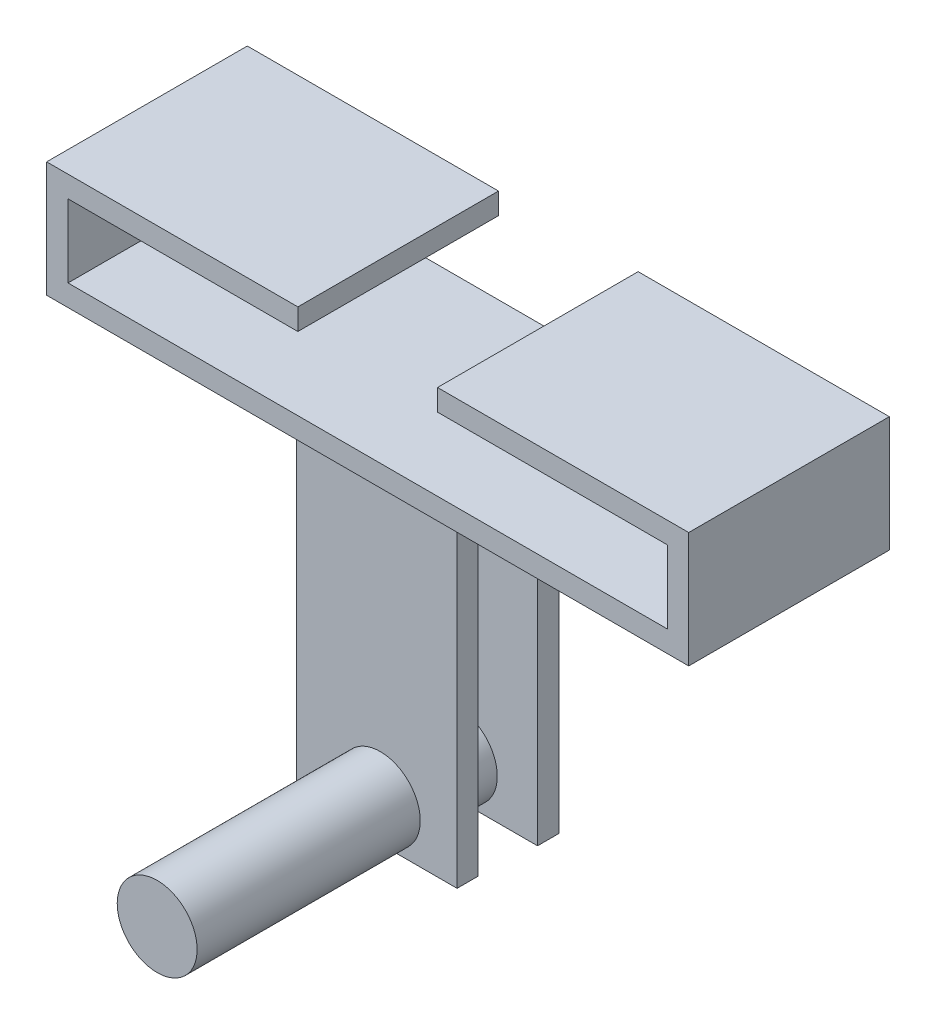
ISO-10303-21;
HEADER;
FILE_DESCRIPTION(('STEP AP214'),'2;1');
FILE_NAME('part.step','',(''),(''),'','','');
FILE_SCHEMA(('AUTOMOTIVE_DESIGN { 1 0 10303 214 1 1 1 1 }'));
ENDSEC;
DATA;
#1=APPLICATION_CONTEXT('core data for automotive mechanical design processes');
#2=APPLICATION_PROTOCOL_DEFINITION('international standard','automotive_design',2000,#1);
#3=PRODUCT_CONTEXT('',#1,'mechanical');
#4=PRODUCT('Part','Part','',(#3));
#5=PRODUCT_RELATED_PRODUCT_CATEGORY('part','',(#4));
#6=PRODUCT_DEFINITION_FORMATION('','',#4);
#7=PRODUCT_DEFINITION_CONTEXT('part definition',#1,'design');
#8=PRODUCT_DEFINITION('design','',#6,#7);
#9=PRODUCT_DEFINITION_SHAPE('','',#8);
#10=(LENGTH_UNIT() NAMED_UNIT(*) SI_UNIT(.MILLI.,.METRE.));
#11=(NAMED_UNIT(*) PLANE_ANGLE_UNIT() SI_UNIT($,.RADIAN.));
#12=(NAMED_UNIT(*) SI_UNIT($,.STERADIAN.) SOLID_ANGLE_UNIT());
#13=UNCERTAINTY_MEASURE_WITH_UNIT(LENGTH_MEASURE(1.E-05),#10,'distance_accuracy_value','');
#14=(GEOMETRIC_REPRESENTATION_CONTEXT(3) GLOBAL_UNCERTAINTY_ASSIGNED_CONTEXT((#13)) GLOBAL_UNIT_ASSIGNED_CONTEXT((#10,
#11,#12)) REPRESENTATION_CONTEXT('',''));
#15=CARTESIAN_POINT('',(0.,0.,0.));
#16=DIRECTION('',(0.,0.,1.));
#17=DIRECTION('',(1.,0.,0.));
#18=AXIS2_PLACEMENT_3D('',#15,#16,#17);
#19=CARTESIAN_POINT('',(0.,0.,0.));
#20=DIRECTION('',(0.,-1.,0.));
#21=DIRECTION('',(0.,0.,-1.));
#22=AXIS2_PLACEMENT_3D('',#19,#20,#21);
#23=PLANE('',#22);
#24=DIRECTION('',(0.,0.,-1.));
#25=VECTOR('',#24,1.);
#26=CARTESIAN_POINT('',(0.,0.,0.));
#27=LINE('',#26,#25);
#28=CARTESIAN_POINT('',(0.,0.,0.));
#29=VERTEX_POINT('',#28);
#30=CARTESIAN_POINT('',(0.,0.,-31.75));
#31=VERTEX_POINT('',#30);
#32=EDGE_CURVE('E298',#29,#31,#27,.T.);
#33=ORIENTED_EDGE('',*,*,#32,.T.);
#34=DIRECTION('',(1.,0.,0.));
#35=VECTOR('',#34,1.);
#36=CARTESIAN_POINT('',(0.,0.,-31.75));
#37=LINE('',#36,#35);
#38=CARTESIAN_POINT('',(101.6,0.,-31.75));
#39=VERTEX_POINT('',#38);
#40=EDGE_CURVE('E322',#31,#39,#37,.T.);
#41=ORIENTED_EDGE('',*,*,#40,.T.);
#42=DIRECTION('',(0.,0.,-1.));
#43=VECTOR('',#42,1.);
#44=CARTESIAN_POINT('',(101.6,0.,0.));
#45=LINE('',#44,#43);
#46=CARTESIAN_POINT('',(101.6,0.,0.));
#47=VERTEX_POINT('',#46);
#48=EDGE_CURVE('E325',#47,#39,#45,.T.);
#49=ORIENTED_EDGE('',*,*,#48,.F.);
#50=DIRECTION('',(1.,0.,0.));
#51=VECTOR('',#50,1.);
#52=CARTESIAN_POINT('',(0.,0.,0.));
#53=LINE('',#52,#51);
#54=EDGE_CURVE('E308',#29,#47,#53,.T.);
#55=ORIENTED_EDGE('',*,*,#54,.F.);
#56=EDGE_LOOP('',(#33,#41,#49,#55));
#57=FACE_BOUND('',#56,.T.);
#58=DIRECTION('',(-1.,0.,0.));
#59=VECTOR('',#58,1.);
#60=CARTESIAN_POINT('',(63.48984,0.,-14.1859));
#61=LINE('',#60,#59);
#62=CARTESIAN_POINT('',(63.48984,0.,-14.1859));
#63=VERTEX_POINT('',#62);
#64=CARTESIAN_POINT('',(38.11016,0.,-14.1859));
#65=VERTEX_POINT('',#64);
#66=EDGE_CURVE('E234',#63,#65,#61,.T.);
#67=ORIENTED_EDGE('',*,*,#66,.F.);
#68=DIRECTION('',(0.,0.,1.));
#69=VECTOR('',#68,1.);
#70=CARTESIAN_POINT('',(63.48984,0.,-17.5641));
#71=LINE('',#70,#69);
#72=CARTESIAN_POINT('',(63.48984,0.,-17.5641));
#73=VERTEX_POINT('',#72);
#74=EDGE_CURVE('E219',#73,#63,#71,.T.);
#75=ORIENTED_EDGE('',*,*,#74,.F.);
#76=DIRECTION('',(1.,0.,0.));
#77=VECTOR('',#76,1.);
#78=CARTESIAN_POINT('',(63.48984,0.,-17.5641));
#79=LINE('',#78,#77);
#80=CARTESIAN_POINT('',(38.11016,0.,-17.5641));
#81=VERTEX_POINT('',#80);
#82=EDGE_CURVE('E225',#81,#73,#79,.T.);
#83=ORIENTED_EDGE('',*,*,#82,.F.);
#84=DIRECTION('',(0.,0.,-1.));
#85=VECTOR('',#84,1.);
#86=CARTESIAN_POINT('',(38.11016,0.,-17.5641));
#87=LINE('',#86,#85);
#88=EDGE_CURVE('E236',#65,#81,#87,.T.);
#89=ORIENTED_EDGE('',*,*,#88,.F.);
#90=EDGE_LOOP('',(#67,#75,#83,#89));
#91=FACE_BOUND('',#90,.T.);
#92=DIRECTION('',(1.,0.,0.));
#93=VECTOR('',#92,1.);
#94=CARTESIAN_POINT('',(37.552154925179,0.,-5.2959));
#95=LINE('',#94,#93);
#96=CARTESIAN_POINT('',(37.552154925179,0.,-5.2959));
#97=VERTEX_POINT('',#96);
#98=CARTESIAN_POINT('',(62.952154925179,0.,-5.2959));
#99=VERTEX_POINT('',#98);
#100=EDGE_CURVE('E597',#97,#99,#95,.T.);
#101=ORIENTED_EDGE('',*,*,#100,.F.);
#102=DIRECTION('',(0.,0.,-1.));
#103=VECTOR('',#102,1.);
#104=CARTESIAN_POINT('',(37.552154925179,0.,-5.2959));
#105=LINE('',#104,#103);
#106=CARTESIAN_POINT('',(37.552154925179,0.,-1.9939));
#107=VERTEX_POINT('',#106);
#108=EDGE_CURVE('E208',#107,#97,#105,.T.);
#109=ORIENTED_EDGE('',*,*,#108,.F.);
#110=DIRECTION('',(-1.,0.,0.));
#111=VECTOR('',#110,1.);
#112=CARTESIAN_POINT('',(37.552154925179,0.,-1.9939));
#113=LINE('',#112,#111);
#114=CARTESIAN_POINT('',(62.952154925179,0.,-1.9939));
#115=VERTEX_POINT('',#114);
#116=EDGE_CURVE('E204',#115,#107,#113,.T.);
#117=ORIENTED_EDGE('',*,*,#116,.F.);
#118=DIRECTION('',(0.,0.,1.));
#119=VECTOR('',#118,1.);
#120=CARTESIAN_POINT('',(62.952154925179,0.,-5.2959));
#121=LINE('',#120,#119);
#122=EDGE_CURVE('E594',#99,#115,#121,.T.);
#123=ORIENTED_EDGE('',*,*,#122,.F.);
#124=EDGE_LOOP('',(#101,#109,#117,#123));
#125=FACE_BOUND('',#124,.T.);
#126=ADVANCED_FACE('F47',(#57,#91,#125),#23,.T.);
#127=CARTESIAN_POINT('',(50.8,-44.45,33.3121));
#128=DIRECTION('',(0.,0.,-1.));
#129=DIRECTION('',(-1.,0.,0.));
#130=AXIS2_PLACEMENT_3D('',#127,#128,#129);
#131=CYLINDRICAL_SURFACE('',#130,6.3246);
#132=CARTESIAN_POINT('',(50.8,-44.45,-14.1859));
#133=DIRECTION('',(0.,0.,1.));
#134=DIRECTION('',(1.,0.,0.));
#135=AXIS2_PLACEMENT_3D('',#132,#133,#134);
#136=CIRCLE('',#135,6.3246);
#137=CARTESIAN_POINT('',(44.4754,-44.45,-14.1859));
#138=VERTEX_POINT('',#137);
#139=EDGE_CURVE('E210',#138,#138,#136,.T.);
#140=CARTESIAN_POINT('',(50.8,-44.45,-5.2959));
#141=DIRECTION('',(0.,0.,1.));
#142=DIRECTION('',(1.,0.,0.));
#143=AXIS2_PLACEMENT_3D('',#140,#141,#142);
#144=CIRCLE('',#143,6.3246);
#145=CARTESIAN_POINT('',(44.4754,-44.45,-5.2959));
#146=VERTEX_POINT('',#145);
#147=EDGE_CURVE('E11',#146,#146,#144,.T.);
#148=CARTESIAN_POINT('',(44.4754,-44.45,-14.1859));
#149=CARTESIAN_POINT('',(44.4754,-44.45,-14.0932958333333));
#150=CARTESIAN_POINT('',(44.4754,-44.45,-14.0006916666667));
#151=CARTESIAN_POINT('',(44.4754,-44.45,-13.8154833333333));
#152=CARTESIAN_POINT('',(44.4754,-44.45,-13.7228791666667));
#153=CARTESIAN_POINT('',(44.4754,-44.45,-13.5376708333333));
#154=CARTESIAN_POINT('',(44.4754,-44.45,-13.4450666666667));
#155=CARTESIAN_POINT('',(44.4754,-44.45,-13.2598583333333));
#156=CARTESIAN_POINT('',(44.4754,-44.45,-13.1672541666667));
#157=CARTESIAN_POINT('',(44.4754,-44.45,-12.9820458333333));
#158=CARTESIAN_POINT('',(44.4754,-44.45,-12.8894416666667));
#159=CARTESIAN_POINT('',(44.4754,-44.45,-12.7042333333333));
#160=CARTESIAN_POINT('',(44.4754,-44.45,-12.6116291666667));
#161=CARTESIAN_POINT('',(44.4754,-44.45,-12.4264208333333));
#162=CARTESIAN_POINT('',(44.4754,-44.45,-12.3338166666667));
#163=CARTESIAN_POINT('',(44.4754,-44.45,-12.1486083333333));
#164=CARTESIAN_POINT('',(44.4754,-44.45,-12.0560041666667));
#165=CARTESIAN_POINT('',(44.4754,-44.45,-11.8707958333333));
#166=CARTESIAN_POINT('',(44.4754,-44.45,-11.7781916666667));
#167=CARTESIAN_POINT('',(44.4754,-44.45,-11.5929833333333));
#168=CARTESIAN_POINT('',(44.4754,-44.45,-11.5003791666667));
#169=CARTESIAN_POINT('',(44.4754,-44.45,-11.3151708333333));
#170=CARTESIAN_POINT('',(44.4754,-44.45,-11.2225666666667));
#171=CARTESIAN_POINT('',(44.4754,-44.45,-11.0373583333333));
#172=CARTESIAN_POINT('',(44.4754,-44.45,-10.9447541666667));
#173=CARTESIAN_POINT('',(44.4754,-44.45,-10.7595458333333));
#174=CARTESIAN_POINT('',(44.4754,-44.45,-10.6669416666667));
#175=CARTESIAN_POINT('',(44.4754,-44.45,-10.4817333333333));
#176=CARTESIAN_POINT('',(44.4754,-44.45,-10.3891291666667));
#177=CARTESIAN_POINT('',(44.4754,-44.45,-10.2039208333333));
#178=CARTESIAN_POINT('',(44.4754,-44.45,-10.1113166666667));
#179=CARTESIAN_POINT('',(44.4754,-44.45,-9.92610833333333));
#180=CARTESIAN_POINT('',(44.4754,-44.45,-9.83350416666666));
#181=CARTESIAN_POINT('',(44.4754,-44.45,-9.64829583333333));
#182=CARTESIAN_POINT('',(44.4754,-44.45,-9.55569166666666));
#183=CARTESIAN_POINT('',(44.4754,-44.45,-9.37048333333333));
#184=CARTESIAN_POINT('',(44.4754,-44.45,-9.27787916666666));
#185=CARTESIAN_POINT('',(44.4754,-44.45,-9.09267083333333));
#186=CARTESIAN_POINT('',(44.4754,-44.45,-9.00006666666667));
#187=CARTESIAN_POINT('',(44.4754,-44.45,-8.81485833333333));
#188=CARTESIAN_POINT('',(44.4754,-44.45,-8.72225416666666));
#189=CARTESIAN_POINT('',(44.4754,-44.45,-8.53704583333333));
#190=CARTESIAN_POINT('',(44.4754,-44.45,-8.44444166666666));
#191=CARTESIAN_POINT('',(44.4754,-44.45,-8.25923333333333));
#192=CARTESIAN_POINT('',(44.4754,-44.45,-8.16662916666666));
#193=CARTESIAN_POINT('',(44.4754,-44.45,-7.98142083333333));
#194=CARTESIAN_POINT('',(44.4754,-44.45,-7.88881666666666));
#195=CARTESIAN_POINT('',(44.4754,-44.45,-7.70360833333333));
#196=CARTESIAN_POINT('',(44.4754,-44.45,-7.61100416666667));
#197=CARTESIAN_POINT('',(44.4754,-44.45,-7.42579583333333));
#198=CARTESIAN_POINT('',(44.4754,-44.45,-7.33319166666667));
#199=CARTESIAN_POINT('',(44.4754,-44.45,-7.14798333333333));
#200=CARTESIAN_POINT('',(44.4754,-44.45,-7.05537916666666));
#201=CARTESIAN_POINT('',(44.4754,-44.45,-6.87017083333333));
#202=CARTESIAN_POINT('',(44.4754,-44.45,-6.77756666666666));
#203=CARTESIAN_POINT('',(44.4754,-44.45,-6.59235833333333));
#204=CARTESIAN_POINT('',(44.4754,-44.45,-6.49975416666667));
#205=CARTESIAN_POINT('',(44.4754,-44.45,-6.31454583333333));
#206=CARTESIAN_POINT('',(44.4754,-44.45,-6.22194166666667));
#207=CARTESIAN_POINT('',(44.4754,-44.45,-6.03673333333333));
#208=CARTESIAN_POINT('',(44.4754,-44.45,-5.94412916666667));
#209=CARTESIAN_POINT('',(44.4754,-44.45,-5.75892083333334));
#210=CARTESIAN_POINT('',(44.4754,-44.45,-5.66631666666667));
#211=CARTESIAN_POINT('',(44.4754,-44.45,-5.48110833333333));
#212=CARTESIAN_POINT('',(44.4754,-44.45,-5.38850416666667));
#213=CARTESIAN_POINT('',(44.4754,-44.45,-5.2959));
#214=B_SPLINE_CURVE_WITH_KNOTS('',3,(#148,#149,#150,#151,#152,#153,#154,#155,#156,#157,#158,
#159,#160,#161,#162,#163,#164,#165,#166,#167,#168,#169,#170,#171,#172,#173,#174,#175,#176,#177,
#178,#179,#180,#181,#182,#183,#184,#185,#186,#187,#188,#189,#190,#191,#192,#193,#194,#195,#196,
#197,#198,#199,#200,#201,#202,#203,#204,#205,#206,#207,#208,#209,#210,#211,#212,#213),
.UNSPECIFIED.,.F.,.F.,(4,2,2,2,2,2,2,2,2,2,2,2,2,2,2,2,2,2,2,2,2,2,2,2,2,2,2,2,2,2,2,2,4),(0.,
0.277812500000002,0.555624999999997,0.833437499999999,1.11125,1.3890625,1.666875,1.9446875,
2.2225,2.5003125,2.778125,3.0559375,3.33375,3.6115625,3.889375,4.1671875,4.445,4.7228125,
5.00062499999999,5.2784375,5.55625,5.8340625,6.111875,6.3896875,6.66749999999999,
6.94531249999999,7.223125,7.5009375,7.77874999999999,8.0565625,8.33437499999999,
8.61218749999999,8.89),.UNSPECIFIED.);
#215=EDGE_CURVE('BSEAM346',#138,#146,#214,.T.);
#216=ORIENTED_EDGE('',*,*,#139,.T.);
#217=ORIENTED_EDGE('',*,*,#147,.F.);
#218=ORIENTED_EDGE('',*,*,#215,.T.);
#219=ORIENTED_EDGE('',*,*,#215,.F.);
#220=EDGE_LOOP('',(#216,#218,#217,#219));
#221=FACE_BOUND('',#220,.T.);
#222=ADVANCED_FACE('F346',(#221),#131,.T.);
#223=CARTESIAN_POINT('',(63.48984,-50.8,-14.1859));
#224=DIRECTION('',(0.,0.,-1.));
#225=DIRECTION('',(-1.,0.,0.));
#226=AXIS2_PLACEMENT_3D('',#223,#224,#225);
#227=PLANE('',#226);
#228=ORIENTED_EDGE('',*,*,#66,.T.);
#229=DIRECTION('',(0.,1.,0.));
#230=VECTOR('',#229,1.);
#231=CARTESIAN_POINT('',(38.11016,-50.8,-14.1859));
#232=LINE('',#231,#230);
#233=CARTESIAN_POINT('',(38.11016,-50.8,-14.1859));
#234=VERTEX_POINT('',#233);
#235=EDGE_CURVE('E242',#234,#65,#232,.T.);
#236=ORIENTED_EDGE('',*,*,#235,.F.);
#237=DIRECTION('',(-1.,0.,0.));
#238=VECTOR('',#237,1.);
#239=CARTESIAN_POINT('',(63.48984,-50.8,-14.1859));
#240=LINE('',#239,#238);
#241=CARTESIAN_POINT('',(63.48984,-50.8,-14.1859));
#242=VERTEX_POINT('',#241);
#243=EDGE_CURVE('E224',#242,#234,#240,.T.);
#244=ORIENTED_EDGE('',*,*,#243,.F.);
#245=DIRECTION('',(0.,1.,0.));
#246=VECTOR('',#245,1.);
#247=CARTESIAN_POINT('',(63.48984,-50.8,-14.1859));
#248=LINE('',#247,#246);
#249=EDGE_CURVE('E245',#242,#63,#248,.T.);
#250=ORIENTED_EDGE('',*,*,#249,.T.);
#251=EDGE_LOOP('',(#228,#236,#244,#250));
#252=FACE_BOUND('',#251,.T.);
#253=ORIENTED_EDGE('',*,*,#139,.F.);
#254=EDGE_LOOP('',(#253));
#255=FACE_BOUND('',#254,.T.);
#256=ADVANCED_FACE('F356',(#252,#255),#227,.F.);
#257=CARTESIAN_POINT('',(0.,18.288,0.));
#258=DIRECTION('',(0.,-1.,0.));
#259=DIRECTION('',(0.,0.,-1.));
#260=AXIS2_PLACEMENT_3D('',#257,#258,#259);
#261=PLANE('',#260);
#262=DIRECTION('',(1.,0.,0.));
#263=VECTOR('',#262,1.);
#264=CARTESIAN_POINT('',(0.,18.288,-31.75));
#265=LINE('',#264,#263);
#266=CARTESIAN_POINT('',(61.849,18.288,-31.75));
#267=VERTEX_POINT('',#266);
#268=CARTESIAN_POINT('',(101.6,18.288,-31.75));
#269=VERTEX_POINT('',#268);
#270=EDGE_CURVE('E307',#267,#269,#265,.T.);
#271=ORIENTED_EDGE('',*,*,#270,.F.);
#272=DIRECTION('',(0.,0.,-1.));
#273=VECTOR('',#272,1.);
#274=CARTESIAN_POINT('',(61.849,18.288,-31.75));
#275=LINE('',#274,#273);
#276=CARTESIAN_POINT('',(61.849,18.288,0.));
#277=VERTEX_POINT('',#276);
#278=EDGE_CURVE('E289',#277,#267,#275,.T.);
#279=ORIENTED_EDGE('',*,*,#278,.F.);
#280=DIRECTION('',(1.,0.,0.));
#281=VECTOR('',#280,1.);
#282=CARTESIAN_POINT('',(0.,18.288,0.));
#283=LINE('',#282,#281);
#284=CARTESIAN_POINT('',(101.6,18.288,0.));
#285=VERTEX_POINT('',#284);
#286=EDGE_CURVE('E315',#277,#285,#283,.T.);
#287=ORIENTED_EDGE('',*,*,#286,.T.);
#288=DIRECTION('',(0.,0.,-1.));
#289=VECTOR('',#288,1.);
#290=CARTESIAN_POINT('',(101.6,18.288,0.));
#291=LINE('',#290,#289);
#292=EDGE_CURVE('E312',#285,#269,#291,.T.);
#293=ORIENTED_EDGE('',*,*,#292,.T.);
#294=EDGE_LOOP('',(#271,#279,#287,#293));
#295=FACE_BOUND('',#294,.T.);
#296=ADVANCED_FACE('F384',(#295),#261,.F.);
#297=CARTESIAN_POINT('',(0.,18.288,0.));
#298=DIRECTION('',(-1.,0.,0.));
#299=DIRECTION('',(0.,0.,1.));
#300=AXIS2_PLACEMENT_3D('',#297,#298,#299);
#301=PLANE('',#300);
#302=ORIENTED_EDGE('',*,*,#32,.F.);
#303=DIRECTION('',(0.,-1.,0.));
#304=VECTOR('',#303,1.);
#305=CARTESIAN_POINT('',(0.,18.288,0.));
#306=LINE('',#305,#304);
#307=CARTESIAN_POINT('',(0.,18.288,0.));
#308=VERTEX_POINT('',#307);
#309=EDGE_CURVE('E329',#308,#29,#306,.T.);
#310=ORIENTED_EDGE('',*,*,#309,.F.);
#311=DIRECTION('',(0.,0.,-1.));
#312=VECTOR('',#311,1.);
#313=CARTESIAN_POINT('',(0.,18.288,0.));
#314=LINE('',#313,#312);
#315=CARTESIAN_POINT('',(0.,18.288,-31.75));
#316=VERTEX_POINT('',#315);
#317=EDGE_CURVE('E304',#308,#316,#314,.T.);
#318=ORIENTED_EDGE('',*,*,#317,.T.);
#319=DIRECTION('',(0.,-1.,0.));
#320=VECTOR('',#319,1.);
#321=CARTESIAN_POINT('',(0.,18.288,-31.75));
#322=LINE('',#321,#320);
#323=EDGE_CURVE('E319',#316,#31,#322,.T.);
#324=ORIENTED_EDGE('',*,*,#323,.T.);
#325=EDGE_LOOP('',(#302,#310,#318,#324));
#326=FACE_BOUND('',#325,.T.);
#327=ADVANCED_FACE('F49',(#326),#301,.T.);
#328=CARTESIAN_POINT('',(0.,18.288,0.));
#329=DIRECTION('',(0.,0.,-1.));
#330=DIRECTION('',(-1.,0.,0.));
#331=AXIS2_PLACEMENT_3D('',#328,#329,#330);
#332=PLANE('',#331);
#333=DIRECTION('',(1.,0.,0.));
#334=VECTOR('',#333,1.);
#335=CARTESIAN_POINT('',(39.751,3.3782,0.));
#336=LINE('',#335,#334);
#337=CARTESIAN_POINT('',(3.3782,3.3782,0.));
#338=VERTEX_POINT('',#337);
#339=CARTESIAN_POINT('',(98.2218,3.3782,0.));
#340=VERTEX_POINT('',#339);
#341=EDGE_CURVE('E288',#338,#340,#336,.T.);
#342=ORIENTED_EDGE('',*,*,#341,.F.);
#343=DIRECTION('',(0.,-1.,0.));
#344=VECTOR('',#343,1.);
#345=CARTESIAN_POINT('',(3.3782,3.3782,0.));
#346=LINE('',#345,#344);
#347=CARTESIAN_POINT('',(3.3782,14.9098,0.));
#348=VERTEX_POINT('',#347);
#349=EDGE_CURVE('E252',#348,#338,#346,.T.);
#350=ORIENTED_EDGE('',*,*,#349,.F.);
#351=DIRECTION('',(-1.,0.,0.));
#352=VECTOR('',#351,1.);
#353=CARTESIAN_POINT('',(39.751,14.9098,0.));
#354=LINE('',#353,#352);
#355=CARTESIAN_POINT('',(39.751,14.9098,0.));
#356=VERTEX_POINT('',#355);
#357=EDGE_CURVE('E256',#356,#348,#354,.T.);
#358=ORIENTED_EDGE('',*,*,#357,.F.);
#359=DIRECTION('',(0.,1.,0.));
#360=VECTOR('',#359,1.);
#361=CARTESIAN_POINT('',(39.751,3.3782,0.));
#362=LINE('',#361,#360);
#363=CARTESIAN_POINT('',(39.751,18.288,0.));
#364=VERTEX_POINT('',#363);
#365=EDGE_CURVE('E301',#356,#364,#362,.T.);
#366=ORIENTED_EDGE('',*,*,#365,.T.);
#367=EDGE_CURVE('E316',#308,#364,#283,.T.);
#368=ORIENTED_EDGE('',*,*,#367,.F.);
#369=ORIENTED_EDGE('',*,*,#309,.T.);
#370=ORIENTED_EDGE('',*,*,#54,.T.);
#371=DIRECTION('',(0.,-1.,0.));
#372=VECTOR('',#371,1.);
#373=CARTESIAN_POINT('',(101.6,18.288,0.));
#374=LINE('',#373,#372);
#375=EDGE_CURVE('E331',#285,#47,#374,.T.);
#376=ORIENTED_EDGE('',*,*,#375,.F.);
#377=ORIENTED_EDGE('',*,*,#286,.F.);
#378=DIRECTION('',(0.,1.,0.));
#379=VECTOR('',#378,1.);
#380=CARTESIAN_POINT('',(61.849,3.3782,0.));
#381=LINE('',#380,#379);
#382=CARTESIAN_POINT('',(61.849,14.9098,0.));
#383=VERTEX_POINT('',#382);
#384=EDGE_CURVE('E299',#383,#277,#381,.T.);
#385=ORIENTED_EDGE('',*,*,#384,.F.);
#386=DIRECTION('',(-1.,0.,0.));
#387=VECTOR('',#386,1.);
#388=CARTESIAN_POINT('',(61.849,14.9098,0.));
#389=LINE('',#388,#387);
#390=CARTESIAN_POINT('',(98.2218,14.9098,0.));
#391=VERTEX_POINT('',#390);
#392=EDGE_CURVE('E277',#391,#383,#389,.T.);
#393=ORIENTED_EDGE('',*,*,#392,.F.);
#394=DIRECTION('',(0.,1.,0.));
#395=VECTOR('',#394,1.);
#396=CARTESIAN_POINT('',(98.2218,3.3782,0.));
#397=LINE('',#396,#395);
#398=EDGE_CURVE('E259',#340,#391,#397,.T.);
#399=ORIENTED_EDGE('',*,*,#398,.F.);
#400=EDGE_LOOP('',(#342,#350,#358,#366,#368,#369,#370,#376,#377,#385,#393,#399));
#401=FACE_BOUND('',#400,.T.);
#402=ADVANCED_FACE('F368',(#401),#332,.F.);
#403=CARTESIAN_POINT('',(101.6,18.288,0.));
#404=DIRECTION('',(-1.,0.,0.));
#405=DIRECTION('',(0.,0.,1.));
#406=AXIS2_PLACEMENT_3D('',#403,#404,#405);
#407=PLANE('',#406);
#408=ORIENTED_EDGE('',*,*,#48,.T.);
#409=DIRECTION('',(0.,-1.,0.));
#410=VECTOR('',#409,1.);
#411=CARTESIAN_POINT('',(101.6,18.288,-31.75));
#412=LINE('',#411,#410);
#413=EDGE_CURVE('E334',#269,#39,#412,.T.);
#414=ORIENTED_EDGE('',*,*,#413,.F.);
#415=ORIENTED_EDGE('',*,*,#292,.F.);
#416=ORIENTED_EDGE('',*,*,#375,.T.);
#417=EDGE_LOOP('',(#408,#414,#415,#416));
#418=FACE_BOUND('',#417,.T.);
#419=ADVANCED_FACE('F371',(#418),#407,.F.);
#420=CARTESIAN_POINT('',(0.,18.288,-31.75));
#421=DIRECTION('',(0.,0.,-1.));
#422=DIRECTION('',(-1.,0.,0.));
#423=AXIS2_PLACEMENT_3D('',#420,#421,#422);
#424=PLANE('',#423);
#425=DIRECTION('',(0.,-1.,0.));
#426=VECTOR('',#425,1.);
#427=CARTESIAN_POINT('',(3.3782,3.3782,-31.75));
#428=LINE('',#427,#426);
#429=CARTESIAN_POINT('',(3.3782,14.9098,-31.75));
#430=VERTEX_POINT('',#429);
#431=CARTESIAN_POINT('',(3.3782,3.3782,-31.75));
#432=VERTEX_POINT('',#431);
#433=EDGE_CURVE('E251',#430,#432,#428,.T.);
#434=ORIENTED_EDGE('',*,*,#433,.T.);
#435=DIRECTION('',(-1.,0.,0.));
#436=VECTOR('',#435,1.);
#437=CARTESIAN_POINT('',(39.751,3.3782,-31.75));
#438=LINE('',#437,#436);
#439=CARTESIAN_POINT('',(98.2218,3.3782,-31.75));
#440=VERTEX_POINT('',#439);
#441=EDGE_CURVE('E286',#440,#432,#438,.T.);
#442=ORIENTED_EDGE('',*,*,#441,.F.);
#443=DIRECTION('',(0.,1.,0.));
#444=VECTOR('',#443,1.);
#445=CARTESIAN_POINT('',(98.2218,3.3782,-31.75));
#446=LINE('',#445,#444);
#447=CARTESIAN_POINT('',(98.2218,14.9098,-31.75));
#448=VERTEX_POINT('',#447);
#449=EDGE_CURVE('E279',#440,#448,#446,.T.);
#450=ORIENTED_EDGE('',*,*,#449,.T.);
#451=DIRECTION('',(-1.,0.,0.));
#452=VECTOR('',#451,1.);
#453=CARTESIAN_POINT('',(61.849,14.9098,-31.75));
#454=LINE('',#453,#452);
#455=CARTESIAN_POINT('',(61.849,14.9098,-31.75));
#456=VERTEX_POINT('',#455);
#457=EDGE_CURVE('E272',#448,#456,#454,.T.);
#458=ORIENTED_EDGE('',*,*,#457,.T.);
#459=DIRECTION('',(0.,1.,0.));
#460=VECTOR('',#459,1.);
#461=CARTESIAN_POINT('',(61.849,3.3782,-31.75));
#462=LINE('',#461,#460);
#463=EDGE_CURVE('E296',#456,#267,#462,.T.);
#464=ORIENTED_EDGE('',*,*,#463,.T.);
#465=ORIENTED_EDGE('',*,*,#270,.T.);
#466=ORIENTED_EDGE('',*,*,#413,.T.);
#467=ORIENTED_EDGE('',*,*,#40,.F.);
#468=ORIENTED_EDGE('',*,*,#323,.F.);
#469=CARTESIAN_POINT('',(39.751,18.288,-31.75));
#470=VERTEX_POINT('',#469);
#471=EDGE_CURVE('E309',#316,#470,#265,.T.);
#472=ORIENTED_EDGE('',*,*,#471,.T.);
#473=DIRECTION('',(0.,1.,0.));
#474=VECTOR('',#473,1.);
#475=CARTESIAN_POINT('',(39.751,3.3782,-31.75));
#476=LINE('',#475,#474);
#477=CARTESIAN_POINT('',(39.751,14.9098,-31.75));
#478=VERTEX_POINT('',#477);
#479=EDGE_CURVE('E291',#478,#470,#476,.T.);
#480=ORIENTED_EDGE('',*,*,#479,.F.);
#481=DIRECTION('',(-1.,0.,0.));
#482=VECTOR('',#481,1.);
#483=CARTESIAN_POINT('',(39.751,14.9098,-31.75));
#484=LINE('',#483,#482);
#485=EDGE_CURVE('E248',#478,#430,#484,.T.);
#486=ORIENTED_EDGE('',*,*,#485,.T.);
#487=EDGE_LOOP('',(#434,#442,#450,#458,#464,#465,#466,#467,#468,#472,#480,#486));
#488=FACE_BOUND('',#487,.T.);
#489=ADVANCED_FACE('F374',(#488),#424,.T.);
#490=ORIENTED_EDGE('',*,*,#367,.T.);
#491=DIRECTION('',(0.,0.,1.));
#492=VECTOR('',#491,1.);
#493=CARTESIAN_POINT('',(39.751,18.288,0.));
#494=LINE('',#493,#492);
#495=EDGE_CURVE('E265',#470,#364,#494,.T.);
#496=ORIENTED_EDGE('',*,*,#495,.F.);
#497=ORIENTED_EDGE('',*,*,#471,.F.);
#498=ORIENTED_EDGE('',*,*,#317,.F.);
#499=EDGE_LOOP('',(#490,#496,#497,#498));
#500=FACE_BOUND('',#499,.T.);
#501=ADVANCED_FACE('F366',(#500),#261,.F.);
#502=CARTESIAN_POINT('',(61.849,3.3782,-31.75));
#503=DIRECTION('',(1.,0.,0.));
#504=DIRECTION('',(0.,0.,-1.));
#505=AXIS2_PLACEMENT_3D('',#502,#503,#504);
#506=PLANE('',#505);
#507=ORIENTED_EDGE('',*,*,#463,.F.);
#508=DIRECTION('',(0.,0.,1.));
#509=VECTOR('',#508,1.);
#510=CARTESIAN_POINT('',(61.849,14.9098,-31.75));
#511=LINE('',#510,#509);
#512=EDGE_CURVE('E247',#456,#383,#511,.T.);
#513=ORIENTED_EDGE('',*,*,#512,.T.);
#514=ORIENTED_EDGE('',*,*,#384,.T.);
#515=ORIENTED_EDGE('',*,*,#278,.T.);
#516=EDGE_LOOP('',(#507,#513,#514,#515));
#517=FACE_BOUND('',#516,.T.);
#518=ADVANCED_FACE('F382',(#517),#506,.F.);
#519=CARTESIAN_POINT('',(39.751,3.3782,0.));
#520=DIRECTION('',(-1.,0.,0.));
#521=DIRECTION('',(0.,0.,1.));
#522=AXIS2_PLACEMENT_3D('',#519,#520,#521);
#523=PLANE('',#522);
#524=ORIENTED_EDGE('',*,*,#365,.F.);
#525=DIRECTION('',(0.,0.,1.));
#526=VECTOR('',#525,1.);
#527=CARTESIAN_POINT('',(39.751,14.9098,-31.75));
#528=LINE('',#527,#526);
#529=EDGE_CURVE('E255',#478,#356,#528,.T.);
#530=ORIENTED_EDGE('',*,*,#529,.F.);
#531=ORIENTED_EDGE('',*,*,#479,.T.);
#532=ORIENTED_EDGE('',*,*,#495,.T.);
#533=EDGE_LOOP('',(#524,#530,#531,#532));
#534=FACE_BOUND('',#533,.T.);
#535=ADVANCED_FACE('F421',(#534),#523,.F.);
#536=CARTESIAN_POINT('',(0.,3.3782,0.));
#537=DIRECTION('',(0.,-1.,0.));
#538=DIRECTION('',(0.,0.,-1.));
#539=AXIS2_PLACEMENT_3D('',#536,#537,#538);
#540=PLANE('',#539);
#541=ORIENTED_EDGE('',*,*,#441,.T.);
#542=DIRECTION('',(0.,0.,1.));
#543=VECTOR('',#542,1.);
#544=CARTESIAN_POINT('',(3.3782,3.3782,-31.75));
#545=LINE('',#544,#543);
#546=EDGE_CURVE('E262',#432,#338,#545,.T.);
#547=ORIENTED_EDGE('',*,*,#546,.T.);
#548=ORIENTED_EDGE('',*,*,#341,.T.);
#549=DIRECTION('',(0.,0.,1.));
#550=VECTOR('',#549,1.);
#551=CARTESIAN_POINT('',(98.2218,3.3782,-31.75));
#552=LINE('',#551,#550);
#553=EDGE_CURVE('E269',#440,#340,#552,.T.);
#554=ORIENTED_EDGE('',*,*,#553,.F.);
#555=EDGE_LOOP('',(#541,#547,#548,#554));
#556=FACE_BOUND('',#555,.T.);
#557=ADVANCED_FACE('F393',(#556),#540,.F.);
#558=CARTESIAN_POINT('',(61.849,14.9098,-31.75));
#559=DIRECTION('',(0.,1.,0.));
#560=DIRECTION('',(-1.,0.,0.));
#561=AXIS2_PLACEMENT_3D('',#558,#559,#560);
#562=PLANE('',#561);
#563=ORIENTED_EDGE('',*,*,#392,.T.);
#564=ORIENTED_EDGE('',*,*,#512,.F.);
#565=ORIENTED_EDGE('',*,*,#457,.F.);
#566=DIRECTION('',(0.,0.,1.));
#567=VECTOR('',#566,1.);
#568=CARTESIAN_POINT('',(98.2218,14.9098,-31.75));
#569=LINE('',#568,#567);
#570=EDGE_CURVE('E273',#448,#391,#569,.T.);
#571=ORIENTED_EDGE('',*,*,#570,.T.);
#572=EDGE_LOOP('',(#563,#564,#565,#571));
#573=FACE_BOUND('',#572,.T.);
#574=ADVANCED_FACE('F427',(#573),#562,.F.);
#575=CARTESIAN_POINT('',(98.2218,3.3782,-31.75));
#576=DIRECTION('',(1.,0.,0.));
#577=DIRECTION('',(0.,0.,-1.));
#578=AXIS2_PLACEMENT_3D('',#575,#576,#577);
#579=PLANE('',#578);
#580=ORIENTED_EDGE('',*,*,#398,.T.);
#581=ORIENTED_EDGE('',*,*,#570,.F.);
#582=ORIENTED_EDGE('',*,*,#449,.F.);
#583=ORIENTED_EDGE('',*,*,#553,.T.);
#584=EDGE_LOOP('',(#580,#581,#582,#583));
#585=FACE_BOUND('',#584,.T.);
#586=ADVANCED_FACE('F397',(#585),#579,.F.);
#587=CARTESIAN_POINT('',(3.3782,3.3782,-31.75));
#588=DIRECTION('',(-1.,0.,0.));
#589=DIRECTION('',(0.,0.,1.));
#590=AXIS2_PLACEMENT_3D('',#587,#588,#589);
#591=PLANE('',#590);
#592=ORIENTED_EDGE('',*,*,#349,.T.);
#593=ORIENTED_EDGE('',*,*,#546,.F.);
#594=ORIENTED_EDGE('',*,*,#433,.F.);
#595=DIRECTION('',(0.,0.,1.));
#596=VECTOR('',#595,1.);
#597=CARTESIAN_POINT('',(3.3782,14.9098,-31.75));
#598=LINE('',#597,#596);
#599=EDGE_CURVE('E266',#430,#348,#598,.T.);
#600=ORIENTED_EDGE('',*,*,#599,.T.);
#601=EDGE_LOOP('',(#592,#593,#594,#600));
#602=FACE_BOUND('',#601,.T.);
#603=ADVANCED_FACE('F390',(#602),#591,.F.);
#604=CARTESIAN_POINT('',(39.751,14.9098,-31.75));
#605=DIRECTION('',(0.,1.,0.));
#606=DIRECTION('',(-1.,0.,0.));
#607=AXIS2_PLACEMENT_3D('',#604,#605,#606);
#608=PLANE('',#607);
#609=ORIENTED_EDGE('',*,*,#357,.T.);
#610=ORIENTED_EDGE('',*,*,#599,.F.);
#611=ORIENTED_EDGE('',*,*,#485,.F.);
#612=ORIENTED_EDGE('',*,*,#529,.T.);
#613=EDGE_LOOP('',(#609,#610,#611,#612));
#614=FACE_BOUND('',#613,.T.);
#615=ADVANCED_FACE('F425',(#614),#608,.F.);
#616=CARTESIAN_POINT('',(63.48984,-50.8,-17.5641));
#617=DIRECTION('',(-1.,0.,0.));
#618=DIRECTION('',(0.,0.,1.));
#619=AXIS2_PLACEMENT_3D('',#616,#617,#618);
#620=PLANE('',#619);
#621=ORIENTED_EDGE('',*,*,#74,.T.);
#622=ORIENTED_EDGE('',*,*,#249,.F.);
#623=DIRECTION('',(0.,0.,1.));
#624=VECTOR('',#623,1.);
#625=CARTESIAN_POINT('',(63.48984,-50.8,-17.5641));
#626=LINE('',#625,#624);
#627=CARTESIAN_POINT('',(63.48984,-50.8,-17.5641));
#628=VERTEX_POINT('',#627);
#629=EDGE_CURVE('E221',#628,#242,#626,.T.);
#630=ORIENTED_EDGE('',*,*,#629,.F.);
#631=DIRECTION('',(0.,1.,0.));
#632=VECTOR('',#631,1.);
#633=CARTESIAN_POINT('',(63.48984,-50.8,-17.5641));
#634=LINE('',#633,#632);
#635=EDGE_CURVE('E231',#628,#73,#634,.T.);
#636=ORIENTED_EDGE('',*,*,#635,.T.);
#637=EDGE_LOOP('',(#621,#622,#630,#636));
#638=FACE_BOUND('',#637,.T.);
#639=ADVANCED_FACE('F479',(#638),#620,.F.);
#640=CARTESIAN_POINT('',(38.11016,-50.8,-17.5641));
#641=DIRECTION('',(1.,0.,0.));
#642=DIRECTION('',(0.,0.,-1.));
#643=AXIS2_PLACEMENT_3D('',#640,#641,#642);
#644=PLANE('',#643);
#645=ORIENTED_EDGE('',*,*,#88,.T.);
#646=DIRECTION('',(0.,1.,0.));
#647=VECTOR('',#646,1.);
#648=CARTESIAN_POINT('',(38.11016,-50.8,-17.5641));
#649=LINE('',#648,#647);
#650=CARTESIAN_POINT('',(38.11016,-50.8,-17.5641));
#651=VERTEX_POINT('',#650);
#652=EDGE_CURVE('E70',#651,#81,#649,.T.);
#653=ORIENTED_EDGE('',*,*,#652,.F.);
#654=DIRECTION('',(0.,0.,-1.));
#655=VECTOR('',#654,1.);
#656=CARTESIAN_POINT('',(38.11016,-50.8,-17.5641));
#657=LINE('',#656,#655);
#658=EDGE_CURVE('E227',#234,#651,#657,.T.);
#659=ORIENTED_EDGE('',*,*,#658,.F.);
#660=ORIENTED_EDGE('',*,*,#235,.T.);
#661=EDGE_LOOP('',(#645,#653,#659,#660));
#662=FACE_BOUND('',#661,.T.);
#663=ADVANCED_FACE('F487',(#662),#644,.F.);
#664=CARTESIAN_POINT('',(63.48984,-50.8,-17.5641));
#665=DIRECTION('',(0.,0.,1.));
#666=DIRECTION('',(1.,0.,0.));
#667=AXIS2_PLACEMENT_3D('',#664,#665,#666);
#668=PLANE('',#667);
#669=ORIENTED_EDGE('',*,*,#82,.T.);
#670=ORIENTED_EDGE('',*,*,#635,.F.);
#671=DIRECTION('',(1.,0.,0.));
#672=VECTOR('',#671,1.);
#673=CARTESIAN_POINT('',(63.48984,-50.8,-17.5641));
#674=LINE('',#673,#672);
#675=EDGE_CURVE('E229',#651,#628,#674,.T.);
#676=ORIENTED_EDGE('',*,*,#675,.F.);
#677=ORIENTED_EDGE('',*,*,#652,.T.);
#678=EDGE_LOOP('',(#669,#670,#676,#677));
#679=FACE_BOUND('',#678,.T.);
#680=ADVANCED_FACE('F497',(#679),#668,.F.);
#681=CARTESIAN_POINT('',(0.,-50.8,0.));
#682=DIRECTION('',(0.,-1.,0.));
#683=DIRECTION('',(0.,0.,-1.));
#684=AXIS2_PLACEMENT_3D('',#681,#682,#683);
#685=PLANE('',#684);
#686=ORIENTED_EDGE('',*,*,#629,.T.);
#687=ORIENTED_EDGE('',*,*,#243,.T.);
#688=ORIENTED_EDGE('',*,*,#658,.T.);
#689=ORIENTED_EDGE('',*,*,#675,.T.);
#690=EDGE_LOOP('',(#686,#687,#688,#689));
#691=FACE_BOUND('',#690,.T.);
#692=ADVANCED_FACE('F507',(#691),#685,.T.);
#693=CARTESIAN_POINT('',(37.552154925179,-50.8,-5.2959));
#694=DIRECTION('',(1.,0.,0.));
#695=DIRECTION('',(0.,0.,-1.));
#696=AXIS2_PLACEMENT_3D('',#693,#694,#695);
#697=PLANE('',#696);
#698=ORIENTED_EDGE('',*,*,#108,.T.);
#699=DIRECTION('',(0.,1.,0.));
#700=VECTOR('',#699,1.);
#701=CARTESIAN_POINT('',(37.552154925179,-50.8,-5.2959));
#702=LINE('',#701,#700);
#703=CARTESIAN_POINT('',(37.552154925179,-50.8,-5.2959));
#704=VERTEX_POINT('',#703);
#705=EDGE_CURVE('E189',#704,#97,#702,.T.);
#706=ORIENTED_EDGE('',*,*,#705,.F.);
#707=DIRECTION('',(0.,0.,-1.));
#708=VECTOR('',#707,1.);
#709=CARTESIAN_POINT('',(37.552154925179,-50.8,-5.2959));
#710=LINE('',#709,#708);
#711=CARTESIAN_POINT('',(37.552154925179,-50.8,-1.9939));
#712=VERTEX_POINT('',#711);
#713=EDGE_CURVE('E196',#712,#704,#710,.T.);
#714=ORIENTED_EDGE('',*,*,#713,.F.);
#715=DIRECTION('',(0.,1.,0.));
#716=VECTOR('',#715,1.);
#717=CARTESIAN_POINT('',(37.552154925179,-50.8,-1.9939));
#718=LINE('',#717,#716);
#719=EDGE_CURVE('E602',#712,#107,#718,.T.);
#720=ORIENTED_EDGE('',*,*,#719,.T.);
#721=EDGE_LOOP('',(#698,#706,#714,#720));
#722=FACE_BOUND('',#721,.T.);
#723=ADVANCED_FACE('F206',(#722),#697,.F.);
#724=CARTESIAN_POINT('',(37.552154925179,-50.8,-5.2959));
#725=DIRECTION('',(0.,0.,1.));
#726=DIRECTION('',(1.,0.,0.));
#727=AXIS2_PLACEMENT_3D('',#724,#725,#726);
#728=PLANE('',#727);
#729=ORIENTED_EDGE('',*,*,#147,.T.);
#730=EDGE_LOOP('',(#729));
#731=FACE_BOUND('',#730,.T.);
#732=ORIENTED_EDGE('',*,*,#100,.T.);
#733=DIRECTION('',(0.,1.,0.));
#734=VECTOR('',#733,1.);
#735=CARTESIAN_POINT('',(62.952154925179,-50.8,-5.2959));
#736=LINE('',#735,#734);
#737=CARTESIAN_POINT('',(62.952154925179,-50.8,-5.2959));
#738=VERTEX_POINT('',#737);
#739=EDGE_CURVE('E192',#738,#99,#736,.T.);
#740=ORIENTED_EDGE('',*,*,#739,.F.);
#741=DIRECTION('',(1.,0.,0.));
#742=VECTOR('',#741,1.);
#743=CARTESIAN_POINT('',(37.552154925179,-50.8,-5.2959));
#744=LINE('',#743,#742);
#745=EDGE_CURVE('E185',#704,#738,#744,.T.);
#746=ORIENTED_EDGE('',*,*,#745,.F.);
#747=ORIENTED_EDGE('',*,*,#705,.T.);
#748=EDGE_LOOP('',(#732,#740,#746,#747));
#749=FACE_BOUND('',#748,.T.);
#750=ADVANCED_FACE('F187',(#731,#749),#728,.F.);
#751=CARTESIAN_POINT('',(62.952154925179,-50.8,-5.2959));
#752=DIRECTION('',(-1.,0.,0.));
#753=DIRECTION('',(0.,0.,1.));
#754=AXIS2_PLACEMENT_3D('',#751,#752,#753);
#755=PLANE('',#754);
#756=ORIENTED_EDGE('',*,*,#122,.T.);
#757=DIRECTION('',(0.,1.,0.));
#758=VECTOR('',#757,1.);
#759=CARTESIAN_POINT('',(62.952154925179,-50.8,-1.9939));
#760=LINE('',#759,#758);
#761=CARTESIAN_POINT('',(62.952154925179,-50.8,-1.9939));
#762=VERTEX_POINT('',#761);
#763=EDGE_CURVE('E62',#762,#115,#760,.T.);
#764=ORIENTED_EDGE('',*,*,#763,.F.);
#765=DIRECTION('',(0.,0.,1.));
#766=VECTOR('',#765,1.);
#767=CARTESIAN_POINT('',(62.952154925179,-50.8,-5.2959));
#768=LINE('',#767,#766);
#769=EDGE_CURVE('E195',#738,#762,#768,.T.);
#770=ORIENTED_EDGE('',*,*,#769,.F.);
#771=ORIENTED_EDGE('',*,*,#739,.T.);
#772=EDGE_LOOP('',(#756,#764,#770,#771));
#773=FACE_BOUND('',#772,.T.);
#774=ADVANCED_FACE('F563',(#773),#755,.F.);
#775=CARTESIAN_POINT('',(37.552154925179,-50.8,-1.9939));
#776=DIRECTION('',(0.,0.,-1.));
#777=DIRECTION('',(-1.,0.,0.));
#778=AXIS2_PLACEMENT_3D('',#775,#776,#777);
#779=PLANE('',#778);
#780=CARTESIAN_POINT('',(50.8,-44.45,-1.9939));
#781=DIRECTION('',(0.,0.,-1.));
#782=DIRECTION('',(-1.,0.,0.));
#783=AXIS2_PLACEMENT_3D('',#780,#781,#782);
#784=CIRCLE('',#783,6.3246);
#785=CARTESIAN_POINT('',(44.4754,-44.45,-1.9939));
#786=VERTEX_POINT('',#785);
#787=EDGE_CURVE('E55',#786,#786,#784,.T.);
#788=ORIENTED_EDGE('',*,*,#787,.T.);
#789=EDGE_LOOP('',(#788));
#790=FACE_BOUND('',#789,.T.);
#791=ORIENTED_EDGE('',*,*,#116,.T.);
#792=ORIENTED_EDGE('',*,*,#719,.F.);
#793=DIRECTION('',(-1.,0.,0.));
#794=VECTOR('',#793,1.);
#795=CARTESIAN_POINT('',(37.552154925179,-50.8,-1.9939));
#796=LINE('',#795,#794);
#797=EDGE_CURVE('E200',#762,#712,#796,.T.);
#798=ORIENTED_EDGE('',*,*,#797,.F.);
#799=ORIENTED_EDGE('',*,*,#763,.T.);
#800=EDGE_LOOP('',(#791,#792,#798,#799));
#801=FACE_BOUND('',#800,.T.);
#802=ADVANCED_FACE('F339',(#790,#801),#779,.F.);
#803=CARTESIAN_POINT('',(0.,-50.8,0.));
#804=DIRECTION('',(0.,1.,0.));
#805=DIRECTION('',(0.,0.,1.));
#806=AXIS2_PLACEMENT_3D('',#803,#804,#805);
#807=PLANE('',#806);
#808=ORIENTED_EDGE('',*,*,#713,.T.);
#809=ORIENTED_EDGE('',*,*,#745,.T.);
#810=ORIENTED_EDGE('',*,*,#769,.T.);
#811=ORIENTED_EDGE('',*,*,#797,.T.);
#812=EDGE_LOOP('',(#808,#809,#810,#811));
#813=FACE_BOUND('',#812,.T.);
#814=ADVANCED_FACE('F199',(#813),#807,.F.);
#815=CARTESIAN_POINT('',(0.,0.,33.3121));
#816=DIRECTION('',(0.,0.,1.));
#817=DIRECTION('',(1.,0.,0.));
#818=AXIS2_PLACEMENT_3D('',#815,#816,#817);
#819=PLANE('',#818);
#820=CARTESIAN_POINT('',(50.8,-44.45,33.3121));
#821=DIRECTION('',(0.,0.,1.));
#822=DIRECTION('',(1.,0.,0.));
#823=AXIS2_PLACEMENT_3D('',#820,#821,#822);
#824=CIRCLE('',#823,6.3246);
#825=CARTESIAN_POINT('',(44.4754,-44.45,33.3121));
#826=VERTEX_POINT('',#825);
#827=EDGE_CURVE('E213',#826,#826,#824,.T.);
#828=ORIENTED_EDGE('',*,*,#827,.T.);
#829=EDGE_LOOP('',(#828));
#830=FACE_BOUND('',#829,.T.);
#831=ADVANCED_FACE('F343',(#830),#819,.T.);
#832=CARTESIAN_POINT('',(44.4754,-44.45,33.3121));
#833=CARTESIAN_POINT('',(44.4754,-44.45,32.9443291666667));
#834=CARTESIAN_POINT('',(44.4754,-44.45,32.5765583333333));
#835=CARTESIAN_POINT('',(44.4754,-44.45,31.8410166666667));
#836=CARTESIAN_POINT('',(44.4754,-44.45,31.4732458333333));
#837=CARTESIAN_POINT('',(44.4754,-44.45,30.7377041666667));
#838=CARTESIAN_POINT('',(44.4754,-44.45,30.3699333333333));
#839=CARTESIAN_POINT('',(44.4754,-44.45,29.6343916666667));
#840=CARTESIAN_POINT('',(44.4754,-44.45,29.2666208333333));
#841=CARTESIAN_POINT('',(44.4754,-44.45,28.5310791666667));
#842=CARTESIAN_POINT('',(44.4754,-44.45,28.1633083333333));
#843=CARTESIAN_POINT('',(44.4754,-44.45,27.4277666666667));
#844=CARTESIAN_POINT('',(44.4754,-44.45,27.0599958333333));
#845=CARTESIAN_POINT('',(44.4754,-44.45,26.3244541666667));
#846=CARTESIAN_POINT('',(44.4754,-44.45,25.9566833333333));
#847=CARTESIAN_POINT('',(44.4754,-44.45,25.2211416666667));
#848=CARTESIAN_POINT('',(44.4754,-44.45,24.8533708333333));
#849=CARTESIAN_POINT('',(44.4754,-44.45,24.1178291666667));
#850=CARTESIAN_POINT('',(44.4754,-44.45,23.7500583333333));
#851=CARTESIAN_POINT('',(44.4754,-44.45,23.0145166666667));
#852=CARTESIAN_POINT('',(44.4754,-44.45,22.6467458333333));
#853=CARTESIAN_POINT('',(44.4754,-44.45,21.9112041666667));
#854=CARTESIAN_POINT('',(44.4754,-44.45,21.5434333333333));
#855=CARTESIAN_POINT('',(44.4754,-44.45,20.8078916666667));
#856=CARTESIAN_POINT('',(44.4754,-44.45,20.4401208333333));
#857=CARTESIAN_POINT('',(44.4754,-44.45,19.7045791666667));
#858=CARTESIAN_POINT('',(44.4754,-44.45,19.3368083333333));
#859=CARTESIAN_POINT('',(44.4754,-44.45,18.6012666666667));
#860=CARTESIAN_POINT('',(44.4754,-44.45,18.2334958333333));
#861=CARTESIAN_POINT('',(44.4754,-44.45,17.4979541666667));
#862=CARTESIAN_POINT('',(44.4754,-44.45,17.1301833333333));
#863=CARTESIAN_POINT('',(44.4754,-44.45,16.3946416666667));
#864=CARTESIAN_POINT('',(44.4754,-44.45,16.0268708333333));
#865=CARTESIAN_POINT('',(44.4754,-44.45,15.2913291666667));
#866=CARTESIAN_POINT('',(44.4754,-44.45,14.9235583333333));
#867=CARTESIAN_POINT('',(44.4754,-44.45,14.1880166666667));
#868=CARTESIAN_POINT('',(44.4754,-44.45,13.8202458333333));
#869=CARTESIAN_POINT('',(44.4754,-44.45,13.0847041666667));
#870=CARTESIAN_POINT('',(44.4754,-44.45,12.7169333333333));
#871=CARTESIAN_POINT('',(44.4754,-44.45,11.9813916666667));
#872=CARTESIAN_POINT('',(44.4754,-44.45,11.6136208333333));
#873=CARTESIAN_POINT('',(44.4754,-44.45,10.8780791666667));
#874=CARTESIAN_POINT('',(44.4754,-44.45,10.5103083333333));
#875=CARTESIAN_POINT('',(44.4754,-44.45,9.77476666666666));
#876=CARTESIAN_POINT('',(44.4754,-44.45,9.40699583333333));
#877=CARTESIAN_POINT('',(44.4754,-44.45,8.67145416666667));
#878=CARTESIAN_POINT('',(44.4754,-44.45,8.30368333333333));
#879=CARTESIAN_POINT('',(44.4754,-44.45,7.56814166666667));
#880=CARTESIAN_POINT('',(44.4754,-44.45,7.20037083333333));
#881=CARTESIAN_POINT('',(44.4754,-44.45,6.46482916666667));
#882=CARTESIAN_POINT('',(44.4754,-44.45,6.09705833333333));
#883=CARTESIAN_POINT('',(44.4754,-44.45,5.36151666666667));
#884=CARTESIAN_POINT('',(44.4754,-44.45,4.99374583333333));
#885=CARTESIAN_POINT('',(44.4754,-44.45,4.25820416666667));
#886=CARTESIAN_POINT('',(44.4754,-44.45,3.89043333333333));
#887=CARTESIAN_POINT('',(44.4754,-44.45,3.15489166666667));
#888=CARTESIAN_POINT('',(44.4754,-44.45,2.78712083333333));
#889=CARTESIAN_POINT('',(44.4754,-44.45,2.05157916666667));
#890=CARTESIAN_POINT('',(44.4754,-44.45,1.68380833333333));
#891=CARTESIAN_POINT('',(44.4754,-44.45,0.948266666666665));
#892=CARTESIAN_POINT('',(44.4754,-44.45,0.580495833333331));
#893=CARTESIAN_POINT('',(44.4754,-44.45,-0.155045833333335));
#894=CARTESIAN_POINT('',(44.4754,-44.45,-0.522816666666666));
#895=CARTESIAN_POINT('',(44.4754,-44.45,-1.25835833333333));
#896=CARTESIAN_POINT('',(44.4754,-44.45,-1.62612916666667));
#897=CARTESIAN_POINT('',(44.4754,-44.45,-1.9939));
#898=B_SPLINE_CURVE_WITH_KNOTS('',3,(#832,#833,#834,#835,#836,#837,#838,#839,#840,#841,#842,
#843,#844,#845,#846,#847,#848,#849,#850,#851,#852,#853,#854,#855,#856,#857,#858,#859,#860,#861,
#862,#863,#864,#865,#866,#867,#868,#869,#870,#871,#872,#873,#874,#875,#876,#877,#878,#879,#880,
#881,#882,#883,#884,#885,#886,#887,#888,#889,#890,#891,#892,#893,#894,#895,#896,#897),
.UNSPECIFIED.,.F.,.F.,(4,2,2,2,2,2,2,2,2,2,2,2,2,2,2,2,2,2,2,2,2,2,2,2,2,2,2,2,2,2,2,2,4),(0.,
1.1033125,2.206625,3.3099375,4.41324999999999,5.5165625,6.61987499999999,7.7231875,
8.82649999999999,9.9298125,11.033125,12.1364375,13.23975,14.3430625,15.446375,16.5496875,17.653,
18.7563125,19.859625,20.9629375,22.06625,23.1695625,24.272875,25.3761875,26.4795,27.5828125,
28.686125,29.7894375,30.89275,31.9960625,33.099375,34.2026875,35.306),.UNSPECIFIED.);
#899=EDGE_CURVE('BSEAM341',#826,#786,#898,.T.);
#900=ORIENTED_EDGE('',*,*,#827,.F.);
#901=ORIENTED_EDGE('',*,*,#787,.F.);
#902=ORIENTED_EDGE('',*,*,#899,.T.);
#903=ORIENTED_EDGE('',*,*,#899,.F.);
#904=EDGE_LOOP('',(#900,#902,#901,#903));
#905=FACE_BOUND('',#904,.T.);
#906=ADVANCED_FACE('F341',(#905),#131,.T.);
#907=CLOSED_SHELL('',(#126,#222,#256,#296,#327,#402,#419,#489,#501,#518,#535,#557,#574,#586,
#603,#615,#639,#663,#680,#692,#723,#750,#774,#802,#814,#831,#906));
#908=MANIFOLD_SOLID_BREP('B2',#907);
#909=ADVANCED_BREP_SHAPE_REPRESENTATION('',(#18,#908),#14);
#910=SHAPE_DEFINITION_REPRESENTATION(#9,#909);
ENDSEC;
END-ISO-10303-21;
